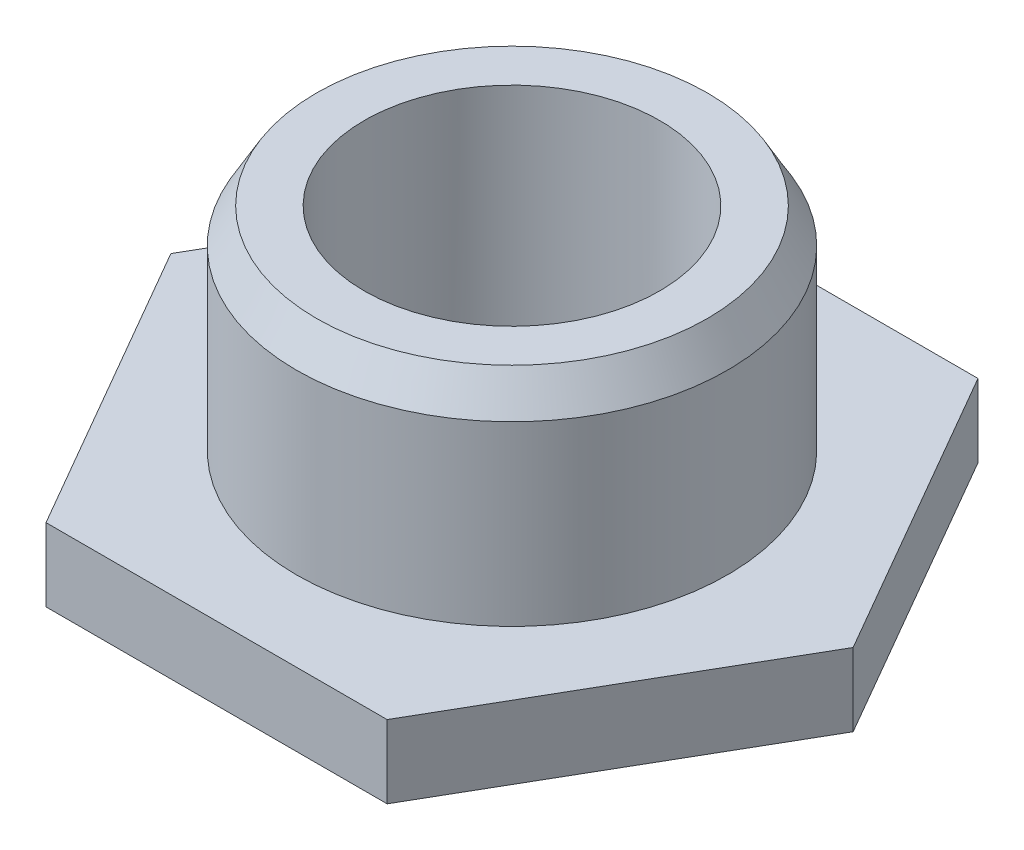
ISO-10303-21;
HEADER;
FILE_DESCRIPTION(('STEP AP214'),'2;1');
FILE_NAME('part.step','',(''),(''),'','','');
FILE_SCHEMA(('AUTOMOTIVE_DESIGN { 1 0 10303 214 1 1 1 1 }'));
ENDSEC;
DATA;
#1=APPLICATION_CONTEXT('core data for automotive mechanical design processes');
#2=APPLICATION_PROTOCOL_DEFINITION('international standard','automotive_design',2000,#1);
#3=PRODUCT_CONTEXT('',#1,'mechanical');
#4=PRODUCT('Part','Part','',(#3));
#5=PRODUCT_RELATED_PRODUCT_CATEGORY('part','',(#4));
#6=PRODUCT_DEFINITION_FORMATION('','',#4);
#7=PRODUCT_DEFINITION_CONTEXT('part definition',#1,'design');
#8=PRODUCT_DEFINITION('design','',#6,#7);
#9=PRODUCT_DEFINITION_SHAPE('','',#8);
#10=(LENGTH_UNIT() NAMED_UNIT(*) SI_UNIT(.MILLI.,.METRE.));
#11=(NAMED_UNIT(*) PLANE_ANGLE_UNIT() SI_UNIT($,.RADIAN.));
#12=(NAMED_UNIT(*) SI_UNIT($,.STERADIAN.) SOLID_ANGLE_UNIT());
#13=UNCERTAINTY_MEASURE_WITH_UNIT(LENGTH_MEASURE(1.E-05),#10,'distance_accuracy_value','');
#14=(GEOMETRIC_REPRESENTATION_CONTEXT(3) GLOBAL_UNCERTAINTY_ASSIGNED_CONTEXT((#13)) GLOBAL_UNIT_ASSIGNED_CONTEXT((#10,
#11,#12)) REPRESENTATION_CONTEXT('',''));
#15=CARTESIAN_POINT('',(0.,0.,0.));
#16=DIRECTION('',(0.,0.,1.));
#17=DIRECTION('',(1.,0.,0.));
#18=AXIS2_PLACEMENT_3D('',#15,#16,#17);
#19=CARTESIAN_POINT('',(4.90747728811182,2.1,8.5));
#20=DIRECTION('',(-0.866025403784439,0.,-0.5));
#21=DIRECTION('',(-0.5,0.,0.866025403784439));
#22=AXIS2_PLACEMENT_3D('',#19,#20,#21);
#23=PLANE('',#22);
#24=DIRECTION('',(0.5,0.,-0.866025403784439));
#25=VECTOR('',#24,1.);
#26=CARTESIAN_POINT('',(4.90747728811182,0.,8.5));
#27=LINE('',#26,#25);
#28=CARTESIAN_POINT('',(4.90747728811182,0.,8.5));
#29=VERTEX_POINT('',#28);
#30=CARTESIAN_POINT('',(9.81495457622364,0.,0.));
#31=VERTEX_POINT('',#30);
#32=EDGE_CURVE('E120',#29,#31,#27,.T.);
#33=ORIENTED_EDGE('',*,*,#32,.T.);
#34=DIRECTION('',(0.,-1.,0.));
#35=VECTOR('',#34,1.);
#36=CARTESIAN_POINT('',(9.81495457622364,2.1,0.));
#37=LINE('',#36,#35);
#38=CARTESIAN_POINT('',(9.81495457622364,2.1,0.));
#39=VERTEX_POINT('',#38);
#40=EDGE_CURVE('E138',#39,#31,#37,.T.);
#41=ORIENTED_EDGE('',*,*,#40,.F.);
#42=DIRECTION('',(0.5,0.,-0.866025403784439));
#43=VECTOR('',#42,1.);
#44=CARTESIAN_POINT('',(4.90747728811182,2.1,8.5));
#45=LINE('',#44,#43);
#46=CARTESIAN_POINT('',(4.90747728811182,2.1,8.5));
#47=VERTEX_POINT('',#46);
#48=EDGE_CURVE('E131',#47,#39,#45,.T.);
#49=ORIENTED_EDGE('',*,*,#48,.F.);
#50=DIRECTION('',(0.,-1.,0.));
#51=VECTOR('',#50,1.);
#52=CARTESIAN_POINT('',(4.90747728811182,2.1,8.5));
#53=LINE('',#52,#51);
#54=EDGE_CURVE('E116',#47,#29,#53,.T.);
#55=ORIENTED_EDGE('',*,*,#54,.T.);
#56=EDGE_LOOP('',(#33,#41,#49,#55));
#57=FACE_BOUND('',#56,.T.);
#58=ADVANCED_FACE('F34',(#57),#23,.F.);
#59=CARTESIAN_POINT('',(9.81495457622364,2.1,0.));
#60=DIRECTION('',(-0.866025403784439,0.,0.5));
#61=DIRECTION('',(0.5,0.,0.866025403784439));
#62=AXIS2_PLACEMENT_3D('',#59,#60,#61);
#63=PLANE('',#62);
#64=DIRECTION('',(-0.5,0.,-0.866025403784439));
#65=VECTOR('',#64,1.);
#66=CARTESIAN_POINT('',(9.81495457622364,0.,0.));
#67=LINE('',#66,#65);
#68=CARTESIAN_POINT('',(4.90747728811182,0.,-8.5));
#69=VERTEX_POINT('',#68);
#70=EDGE_CURVE('E123',#31,#69,#67,.T.);
#71=ORIENTED_EDGE('',*,*,#70,.T.);
#72=DIRECTION('',(0.,-1.,0.));
#73=VECTOR('',#72,1.);
#74=CARTESIAN_POINT('',(4.90747728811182,2.1,-8.5));
#75=LINE('',#74,#73);
#76=CARTESIAN_POINT('',(4.90747728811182,2.1,-8.5));
#77=VERTEX_POINT('',#76);
#78=EDGE_CURVE('E135',#77,#69,#75,.T.);
#79=ORIENTED_EDGE('',*,*,#78,.F.);
#80=DIRECTION('',(-0.5,0.,-0.866025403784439));
#81=VECTOR('',#80,1.);
#82=CARTESIAN_POINT('',(9.81495457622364,2.1,0.));
#83=LINE('',#82,#81);
#84=EDGE_CURVE('E89',#39,#77,#83,.T.);
#85=ORIENTED_EDGE('',*,*,#84,.F.);
#86=ORIENTED_EDGE('',*,*,#40,.T.);
#87=EDGE_LOOP('',(#71,#79,#85,#86));
#88=FACE_BOUND('',#87,.T.);
#89=ADVANCED_FACE('F157',(#88),#63,.F.);
#90=CARTESIAN_POINT('',(4.90747728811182,2.1,-8.5));
#91=DIRECTION('',(0.,0.,1.));
#92=DIRECTION('',(1.,0.,0.));
#93=AXIS2_PLACEMENT_3D('',#90,#91,#92);
#94=PLANE('',#93);
#95=DIRECTION('',(-1.,0.,0.));
#96=VECTOR('',#95,1.);
#97=CARTESIAN_POINT('',(4.90747728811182,0.,-8.5));
#98=LINE('',#97,#96);
#99=CARTESIAN_POINT('',(-4.90747728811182,0.,-8.5));
#100=VERTEX_POINT('',#99);
#101=EDGE_CURVE('E126',#69,#100,#98,.T.);
#102=ORIENTED_EDGE('',*,*,#101,.T.);
#103=DIRECTION('',(0.,-1.,0.));
#104=VECTOR('',#103,1.);
#105=CARTESIAN_POINT('',(-4.90747728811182,2.1,-8.5));
#106=LINE('',#105,#104);
#107=CARTESIAN_POINT('',(-4.90747728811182,2.1,-8.5));
#108=VERTEX_POINT('',#107);
#109=EDGE_CURVE('E111',#108,#100,#106,.T.);
#110=ORIENTED_EDGE('',*,*,#109,.F.);
#111=DIRECTION('',(-1.,0.,0.));
#112=VECTOR('',#111,1.);
#113=CARTESIAN_POINT('',(4.90747728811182,2.1,-8.5));
#114=LINE('',#113,#112);
#115=EDGE_CURVE('E102',#77,#108,#114,.T.);
#116=ORIENTED_EDGE('',*,*,#115,.F.);
#117=ORIENTED_EDGE('',*,*,#78,.T.);
#118=EDGE_LOOP('',(#102,#110,#116,#117));
#119=FACE_BOUND('',#118,.T.);
#120=ADVANCED_FACE('F160',(#119),#94,.F.);
#121=CARTESIAN_POINT('',(-4.90747728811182,2.1,-8.5));
#122=DIRECTION('',(0.866025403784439,0.,0.5));
#123=DIRECTION('',(0.5,0.,-0.866025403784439));
#124=AXIS2_PLACEMENT_3D('',#121,#122,#123);
#125=PLANE('',#124);
#126=DIRECTION('',(-0.5,0.,0.866025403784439));
#127=VECTOR('',#126,1.);
#128=CARTESIAN_POINT('',(-4.90747728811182,0.,-8.5));
#129=LINE('',#128,#127);
#130=CARTESIAN_POINT('',(-9.81495457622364,0.,0.));
#131=VERTEX_POINT('',#130);
#132=EDGE_CURVE('E110',#100,#131,#129,.T.);
#133=ORIENTED_EDGE('',*,*,#132,.T.);
#134=DIRECTION('',(0.,-1.,0.));
#135=VECTOR('',#134,1.);
#136=CARTESIAN_POINT('',(-9.81495457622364,2.1,0.));
#137=LINE('',#136,#135);
#138=CARTESIAN_POINT('',(-9.81495457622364,2.1,0.));
#139=VERTEX_POINT('',#138);
#140=EDGE_CURVE('E107',#139,#131,#137,.T.);
#141=ORIENTED_EDGE('',*,*,#140,.F.);
#142=DIRECTION('',(-0.5,0.,0.866025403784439));
#143=VECTOR('',#142,1.);
#144=CARTESIAN_POINT('',(-4.90747728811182,2.1,-8.5));
#145=LINE('',#144,#143);
#146=EDGE_CURVE('E96',#108,#139,#145,.T.);
#147=ORIENTED_EDGE('',*,*,#146,.F.);
#148=ORIENTED_EDGE('',*,*,#109,.T.);
#149=EDGE_LOOP('',(#133,#141,#147,#148));
#150=FACE_BOUND('',#149,.T.);
#151=ADVANCED_FACE('F108',(#150),#125,.F.);
#152=CARTESIAN_POINT('',(-9.81495457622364,2.1,0.));
#153=DIRECTION('',(0.866025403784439,0.,-0.5));
#154=DIRECTION('',(-0.5,0.,-0.866025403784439));
#155=AXIS2_PLACEMENT_3D('',#152,#153,#154);
#156=PLANE('',#155);
#157=DIRECTION('',(0.5,0.,0.866025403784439));
#158=VECTOR('',#157,1.);
#159=CARTESIAN_POINT('',(-9.81495457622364,0.,0.));
#160=LINE('',#159,#158);
#161=CARTESIAN_POINT('',(-4.90747728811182,0.,8.5));
#162=VERTEX_POINT('',#161);
#163=EDGE_CURVE('E74',#131,#162,#160,.T.);
#164=ORIENTED_EDGE('',*,*,#163,.T.);
#165=DIRECTION('',(0.,-1.,0.));
#166=VECTOR('',#165,1.);
#167=CARTESIAN_POINT('',(-4.90747728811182,2.1,8.5));
#168=LINE('',#167,#166);
#169=CARTESIAN_POINT('',(-4.90747728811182,2.1,8.5));
#170=VERTEX_POINT('',#169);
#171=EDGE_CURVE('E112',#170,#162,#168,.T.);
#172=ORIENTED_EDGE('',*,*,#171,.F.);
#173=DIRECTION('',(0.5,0.,0.866025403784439));
#174=VECTOR('',#173,1.);
#175=CARTESIAN_POINT('',(-9.81495457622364,2.1,0.));
#176=LINE('',#175,#174);
#177=EDGE_CURVE('E100',#139,#170,#176,.T.);
#178=ORIENTED_EDGE('',*,*,#177,.F.);
#179=ORIENTED_EDGE('',*,*,#140,.T.);
#180=EDGE_LOOP('',(#164,#172,#178,#179));
#181=FACE_BOUND('',#180,.T.);
#182=ADVANCED_FACE('F114',(#181),#156,.F.);
#183=CARTESIAN_POINT('',(-4.90747728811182,2.1,8.5));
#184=DIRECTION('',(0.,0.,-1.));
#185=DIRECTION('',(-1.,0.,0.));
#186=AXIS2_PLACEMENT_3D('',#183,#184,#185);
#187=PLANE('',#186);
#188=DIRECTION('',(1.,0.,0.));
#189=VECTOR('',#188,1.);
#190=CARTESIAN_POINT('',(-4.90747728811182,0.,8.5));
#191=LINE('',#190,#189);
#192=EDGE_CURVE('E80',#162,#29,#191,.T.);
#193=ORIENTED_EDGE('',*,*,#192,.T.);
#194=ORIENTED_EDGE('',*,*,#54,.F.);
#195=DIRECTION('',(1.,0.,0.));
#196=VECTOR('',#195,1.);
#197=CARTESIAN_POINT('',(-4.90747728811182,2.1,8.5));
#198=LINE('',#197,#196);
#199=EDGE_CURVE('E51',#170,#47,#198,.T.);
#200=ORIENTED_EDGE('',*,*,#199,.F.);
#201=ORIENTED_EDGE('',*,*,#171,.T.);
#202=EDGE_LOOP('',(#193,#194,#200,#201));
#203=FACE_BOUND('',#202,.T.);
#204=ADVANCED_FACE('F165',(#203),#187,.F.);
#205=CARTESIAN_POINT('',(0.,2.1,0.));
#206=DIRECTION('',(0.,1.,0.));
#207=DIRECTION('',(0.,0.,1.));
#208=AXIS2_PLACEMENT_3D('',#205,#206,#207);
#209=PLANE('',#208);
#210=CARTESIAN_POINT('',(0.,2.1,0.));
#211=DIRECTION('',(0.,1.,0.));
#212=DIRECTION('',(0.,0.,1.));
#213=AXIS2_PLACEMENT_3D('',#210,#211,#212);
#214=CIRCLE('',#213,6.2);
#215=CARTESIAN_POINT('',(0.,2.1,6.2));
#216=VERTEX_POINT('',#215);
#217=EDGE_CURVE('E140',#216,#216,#214,.T.);
#218=ORIENTED_EDGE('',*,*,#217,.F.);
#219=EDGE_LOOP('',(#218));
#220=FACE_BOUND('',#219,.T.);
#221=ORIENTED_EDGE('',*,*,#48,.T.);
#222=ORIENTED_EDGE('',*,*,#84,.T.);
#223=ORIENTED_EDGE('',*,*,#115,.T.);
#224=ORIENTED_EDGE('',*,*,#146,.T.);
#225=ORIENTED_EDGE('',*,*,#177,.T.);
#226=ORIENTED_EDGE('',*,*,#199,.T.);
#227=EDGE_LOOP('',(#221,#222,#223,#224,#225,#226));
#228=FACE_BOUND('',#227,.T.);
#229=ADVANCED_FACE('F98',(#220,#228),#209,.T.);
#230=CARTESIAN_POINT('',(0.,0.,0.));
#231=DIRECTION('',(0.,1.,0.));
#232=DIRECTION('',(0.,0.,1.));
#233=AXIS2_PLACEMENT_3D('',#230,#231,#232);
#234=PLANE('',#233);
#235=CARTESIAN_POINT('',(0.,0.,0.));
#236=DIRECTION('',(0.,-1.,0.));
#237=DIRECTION('',(0.,0.,-1.));
#238=AXIS2_PLACEMENT_3D('',#235,#236,#237);
#239=CIRCLE('',#238,7.7);
#240=CARTESIAN_POINT('',(0.,0.,-7.7));
#241=VERTEX_POINT('',#240);
#242=EDGE_CURVE('E124',#241,#241,#239,.T.);
#243=ORIENTED_EDGE('',*,*,#242,.F.);
#244=EDGE_LOOP('',(#243));
#245=FACE_BOUND('',#244,.T.);
#246=ORIENTED_EDGE('',*,*,#32,.F.);
#247=ORIENTED_EDGE('',*,*,#192,.F.);
#248=ORIENTED_EDGE('',*,*,#163,.F.);
#249=ORIENTED_EDGE('',*,*,#132,.F.);
#250=ORIENTED_EDGE('',*,*,#101,.F.);
#251=ORIENTED_EDGE('',*,*,#70,.F.);
#252=EDGE_LOOP('',(#246,#247,#248,#249,#250,#251));
#253=FACE_BOUND('',#252,.T.);
#254=ADVANCED_FACE('F163',(#245,#253),#234,.F.);
#255=CARTESIAN_POINT('',(0.,8.2,0.));
#256=DIRECTION('',(0.,-1.,0.));
#257=DIRECTION('',(0.,0.,-1.));
#258=AXIS2_PLACEMENT_3D('',#255,#256,#257);
#259=CYLINDRICAL_SURFACE('',#258,6.2);
#260=CARTESIAN_POINT('',(0.,7.2,0.));
#261=DIRECTION('',(0.,1.,0.));
#262=DIRECTION('',(0.,0.,1.));
#263=AXIS2_PLACEMENT_3D('',#260,#261,#262);
#264=CIRCLE('',#263,6.2);
#265=CARTESIAN_POINT('',(0.,7.2,6.2));
#266=VERTEX_POINT('',#265);
#267=EDGE_CURVE('E11',#266,#266,#264,.F.);
#268=ORIENTED_EDGE('',*,*,#267,.T.);
#269=EDGE_LOOP('',(#268));
#270=FACE_BOUND('',#269,.T.);
#271=ORIENTED_EDGE('',*,*,#217,.T.);
#272=EDGE_LOOP('',(#271));
#273=FACE_BOUND('',#272,.T.);
#274=ADVANCED_FACE('F212',(#270,#273),#259,.T.);
#275=CARTESIAN_POINT('',(0.,8.2,0.));
#276=DIRECTION('',(0.,1.,0.));
#277=DIRECTION('',(0.,0.,1.));
#278=AXIS2_PLACEMENT_3D('',#275,#276,#277);
#279=PLANE('',#278);
#280=CARTESIAN_POINT('',(0.,8.2,0.));
#281=DIRECTION('',(0.,1.,0.));
#282=DIRECTION('',(0.,0.,1.));
#283=AXIS2_PLACEMENT_3D('',#280,#281,#282);
#284=CIRCLE('',#283,5.62264973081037);
#285=CARTESIAN_POINT('',(0.,8.2,5.62264973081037));
#286=VERTEX_POINT('',#285);
#287=EDGE_CURVE('E43',#286,#286,#284,.T.);
#288=ORIENTED_EDGE('',*,*,#287,.T.);
#289=EDGE_LOOP('',(#288));
#290=FACE_BOUND('',#289,.T.);
#291=CARTESIAN_POINT('',(0.,8.2,0.));
#292=DIRECTION('',(0.,1.,0.));
#293=DIRECTION('',(0.,0.,1.));
#294=AXIS2_PLACEMENT_3D('',#291,#292,#293);
#295=CIRCLE('',#294,4.25);
#296=CARTESIAN_POINT('',(0.,8.2,4.25));
#297=VERTEX_POINT('',#296);
#298=EDGE_CURVE('E143',#297,#297,#295,.T.);
#299=ORIENTED_EDGE('',*,*,#298,.F.);
#300=EDGE_LOOP('',(#299));
#301=FACE_BOUND('',#300,.T.);
#302=ADVANCED_FACE('F225',(#290,#301),#279,.T.);
#303=CARTESIAN_POINT('',(0.,0.,0.));
#304=DIRECTION('',(0.,-1.,0.));
#305=DIRECTION('',(0.,0.,-1.));
#306=AXIS2_PLACEMENT_3D('',#303,#304,#305);
#307=CONICAL_SURFACE('',#306,7.7,1.19927847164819);
#308=CARTESIAN_POINT('',(0.,1.34415584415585,0.));
#309=DIRECTION('',(0.,-1.,0.));
#310=DIRECTION('',(0.,0.,-1.));
#311=AXIS2_PLACEMENT_3D('',#308,#309,#310);
#312=CIRCLE('',#311,4.25);
#313=CARTESIAN_POINT('',(0.,1.34415584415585,-4.25));
#314=VERTEX_POINT('',#313);
#315=EDGE_CURVE('E141',#314,#314,#312,.F.);
#316=ORIENTED_EDGE('',*,*,#315,.T.);
#317=EDGE_LOOP('',(#316));
#318=FACE_BOUND('',#317,.T.);
#319=ORIENTED_EDGE('',*,*,#242,.T.);
#320=EDGE_LOOP('',(#319));
#321=FACE_BOUND('',#320,.T.);
#322=ADVANCED_FACE('F219',(#318,#321),#307,.F.);
#323=CARTESIAN_POINT('',(0.,0.,0.));
#324=DIRECTION('',(0.,1.,0.));
#325=DIRECTION('',(0.,0.,1.));
#326=AXIS2_PLACEMENT_3D('',#323,#324,#325);
#327=CYLINDRICAL_SURFACE('',#326,4.25);
#328=ORIENTED_EDGE('',*,*,#298,.T.);
#329=EDGE_LOOP('',(#328));
#330=FACE_BOUND('',#329,.T.);
#331=ORIENTED_EDGE('',*,*,#315,.F.);
#332=EDGE_LOOP('',(#331));
#333=FACE_BOUND('',#332,.T.);
#334=ADVANCED_FACE('F224',(#330,#333),#327,.F.);
#335=CARTESIAN_POINT('',(0.,8.2,0.));
#336=DIRECTION('',(0.,-1.,0.));
#337=DIRECTION('',(0.,0.,-1.));
#338=AXIS2_PLACEMENT_3D('',#335,#336,#337);
#339=CONICAL_SURFACE('',#338,5.62264973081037,0.523598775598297);
#340=ORIENTED_EDGE('',*,*,#267,.F.);
#341=EDGE_LOOP('',(#340));
#342=FACE_BOUND('',#341,.T.);
#343=ORIENTED_EDGE('',*,*,#287,.F.);
#344=EDGE_LOOP('',(#343));
#345=FACE_BOUND('',#344,.T.);
#346=ADVANCED_FACE('F36',(#342,#345),#339,.T.);
#347=CLOSED_SHELL('',(#58,#89,#120,#151,#182,#204,#229,#254,#274,#302,#322,#334,#346));
#348=MANIFOLD_SOLID_BREP('B2',#347);
#349=ADVANCED_BREP_SHAPE_REPRESENTATION('',(#18,#348),#14);
#350=SHAPE_DEFINITION_REPRESENTATION(#9,#349);
ENDSEC;
END-ISO-10303-21;
